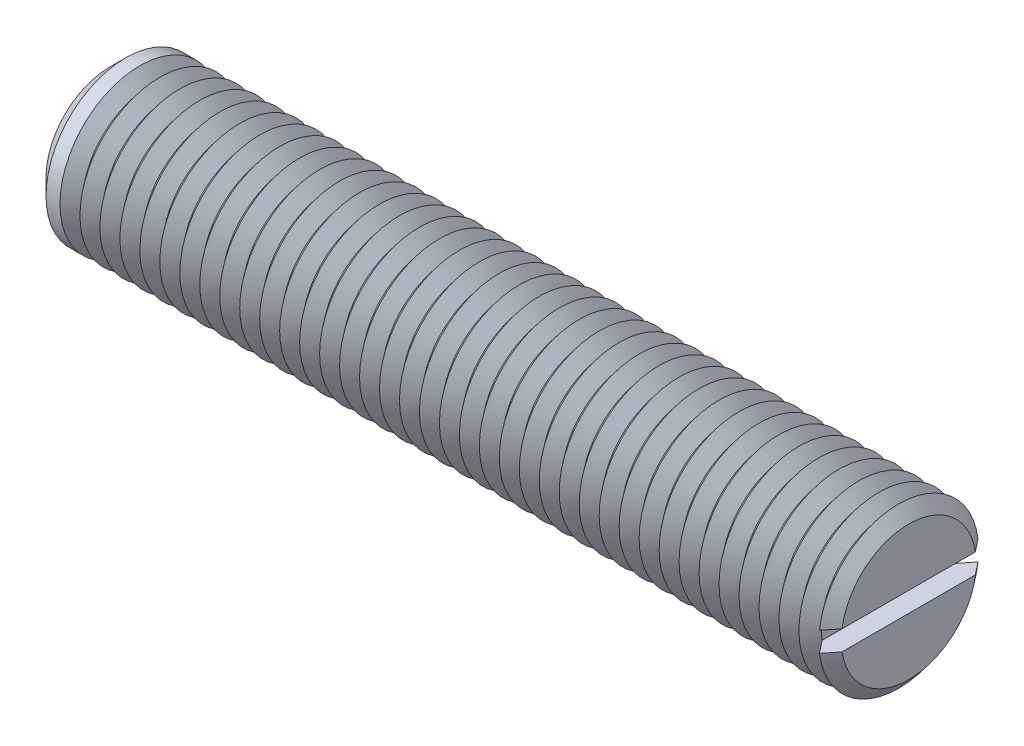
from build123d import *

# Parameters (mm, degrees)
SKETCH1_R       = 8
EXTRUDE1_DEPTH  = 40
SKETCH2_W       = 2
SKETCH2_H       = 2
EXTRUDE2_DEPTH  = 12
CHAMFER1_SIZE   = 1.6
LPATTERN1_COUNT = 39
LPATTERN1_PITCH = 2


with BuildPart() as part:
    # Sketch1 → Extrude1 (new, symmetric)
    with BuildSketch(Plane(origin=(0, 0, 0), x_dir=(0, 0, -1), z_dir=(1, 0, 0))):
        Circle(SKETCH1_R)
    extrude(amount=EXTRUDE1_DEPTH, both=True)

    # Sketch2 → Extrude2 (cut, symmetric)
    with BuildSketch(Plane.XY):
        with Locations((39, 0)):
            Rectangle(SKETCH2_W, SKETCH2_H)
    extrude(amount=EXTRUDE2_DEPTH, both=True, mode=Mode.SUBTRACT)

    # Chamfer1
    chamfer1_edges = [part.edges().sort_by_distance(p)[0] for p in [
        (-40, 0, 8),
    ]]
    chamfer(chamfer1_edges, length=CHAMFER1_SIZE)

    # Sketch3 → Cut-Revolve1 (revolve, cut)
    with BuildSketch(Plane.XY, mode=Mode.PRIVATE) as cut_revolve1_sk:
        Polygon((39, -8), (41, -8), (40, -6.7510004), align=None)
    cut_revolve1 = revolve(cut_revolve1_sk.sketch.rotate(Axis((0, 0, 0), (1, 0, 0)), 277.180755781), axis=Axis((0, 0, 0), (1, 0, 0)), mode=Mode.SUBTRACT)

    # LPattern1: Cut-Revolve1 ×39
    with Locations(*[(-i * LPATTERN1_PITCH, 0, 0) for i in range(1, LPATTERN1_COUNT)]):
        add(cut_revolve1, mode=Mode.SUBTRACT)


solid = part.part
